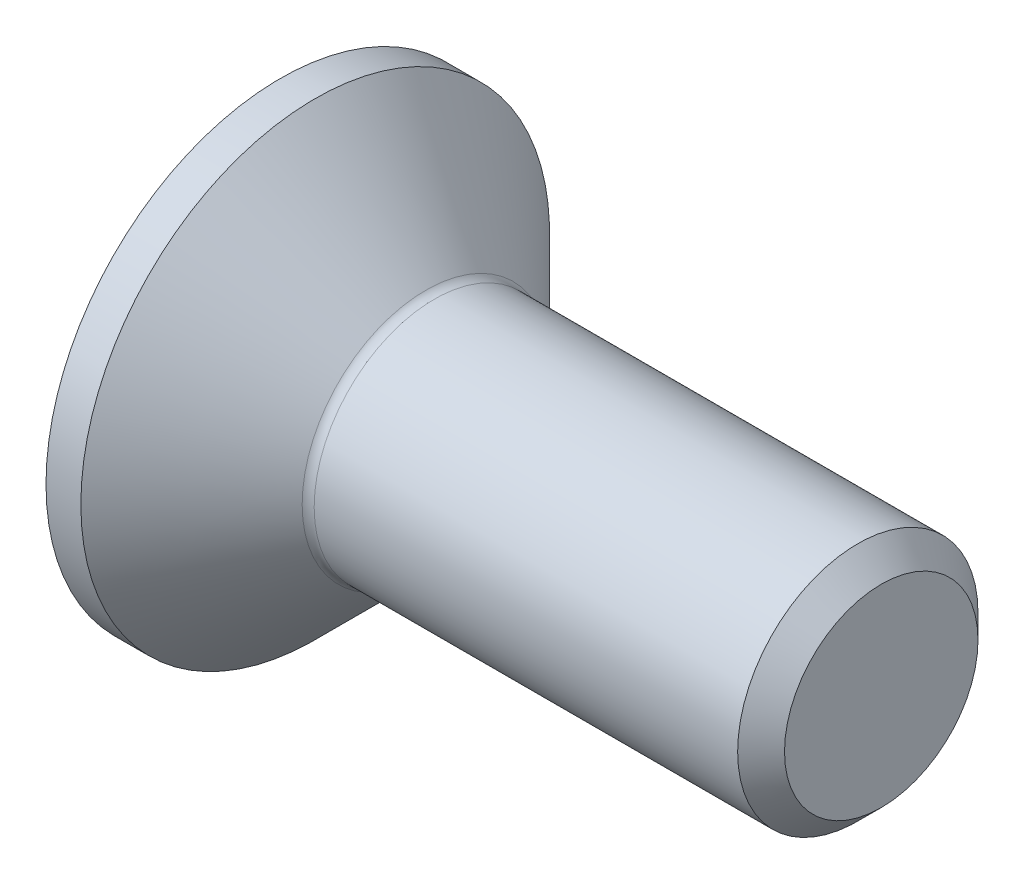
from build123d import *

# Parameters (mm, degrees)
FILLET1_R   = 0.2
HEX_2_DEPTH = 1.5


with BuildPart() as part:
    # BodySke → BaseBody (revolve)
    with BuildSketch(Plane.XY, mode=Mode.PRIVATE) as basebody_sk:
        Polygon((0, 0), (0, 3.9), (0.58, 3.9), (2.48, 2), (9.61, 2), (10, 1.61), (10, 0), align=None)
    revolve(basebody_sk.sketch.rotate(Axis((0, 0, 0), (1, 0, 0)), 90), axis=Axis((0, 0, 0), (1, 0, 0)))

    # Fillet1
    fillet1_edges = [part.edges().sort_by_distance(p)[0] for p in [
        (2.48, 0, -2),
    ]]
    fillet(fillet1_edges, radius=FILLET1_R)

    # Sketch2 → PreBroach (revolve, cut)
    with BuildSketch(Plane.XY, mode=Mode.PRIVATE) as prebroach_sk:
        Polygon((0, 1.25), (1.5, 1.25), (2.221687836, 0), (0, 0), align=None)
    revolve(prebroach_sk.sketch.rotate(Axis((0, 0, 0), (1, 0, 0)), 90), axis=Axis((0, 0, 0), (1, 0, 0)), mode=Mode.SUBTRACT)

    # Sketch3 → Hex 2 (cut)
    with BuildSketch(Plane.ZY):
        Polygon((-1.25, -0.721687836), (-1.25, 0.721687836), (0, 1.443375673), (1.25, 0.721687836), (1.25, -0.721687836), (0, -1.443375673), align=None)
    extrude(amount=-HEX_2_DEPTH, mode=Mode.SUBTRACT)


solid = part.part
